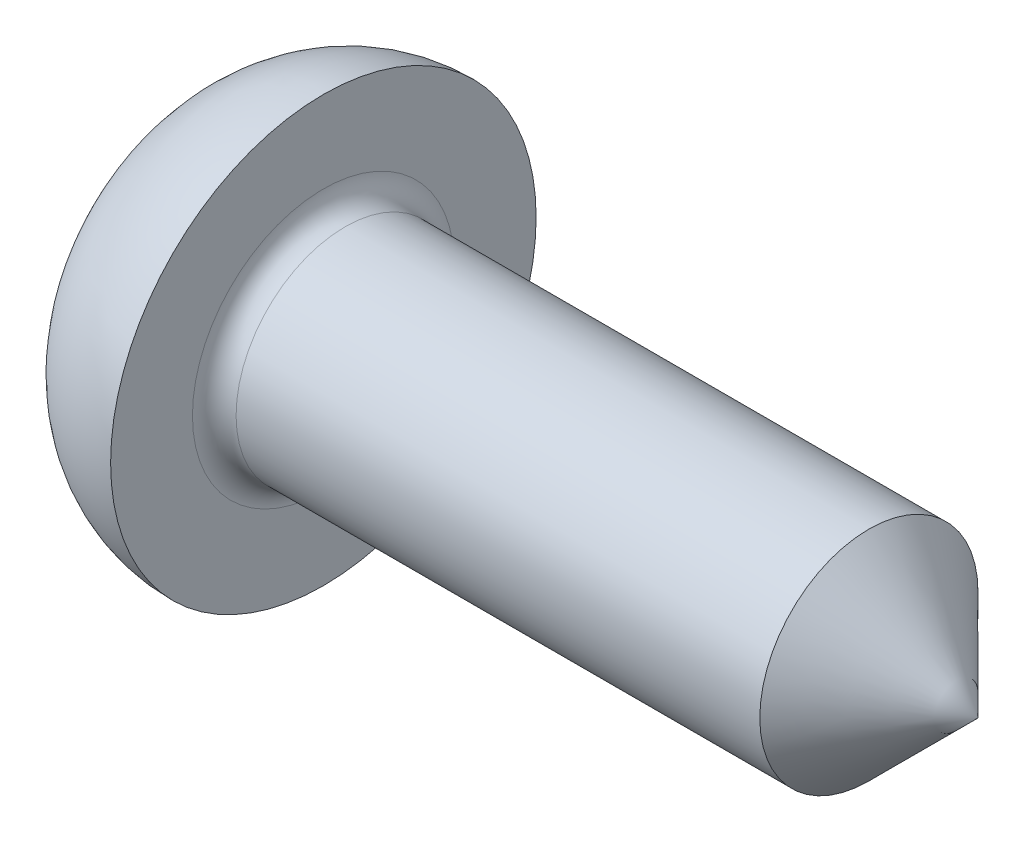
from build123d import *

# Parameters (mm, degrees)
FILLET2_R = 0.2


with BuildPart() as part:
    # Sketch1 → Revolve1 (revolve)
    with BuildSketch(Plane(origin=(0, 0, 0), x_dir=(1, 0, 0), z_dir=(0, 1, 0)), mode=Mode.PRIVATE) as revolve1_sk:
        with BuildLine():
            Line((1.6, 1), (7.6, 1))
            Line((7.6, 1), (7.6, 0))
            Line((7.6, 0), (0, 0))
            ThreePointArc((0, 0), (0.12318754, 0.742622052), (0.479554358, 1.405694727))
            ThreePointArc((0.479554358, 1.405694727), (0.97590539, 1.809326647), (1.6, 1.95))
            Line((1.6, 1.95), (1.6, 1))
        make_face()
    revolve(revolve1_sk.sketch.rotate(Axis((-13.629268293, 0, 0), (1, 0, 0)), 180), axis=Axis((-13.629268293, 0, 0), (1, 0, 0)))

    # Fillet2
    fillet2_edges = [part.edges().sort_by_distance(p)[0] for p in [
        (1.6, 0, -1),
    ]]
    fillet(fillet2_edges, radius=FILLET2_R)

    # Sketch4 → Cut-Revolve1 (revolve, cut)
    with BuildSketch(Plane(origin=(0, 0, 0), x_dir=(1, 0, 0), z_dir=(0, 1, 0)), mode=Mode.PRIVATE) as cut_revolve1_sk:
        Polygon((8.333454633, 0), (8.333454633, 21), (-13.4, 21), (7.6, 0), align=None)
    revolve(cut_revolve1_sk.sketch.rotate(Axis((4.782773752, 0, 0), (1, 0, 0)), 180), axis=Axis((4.782773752, 0, 0), (1, 0, 0)), mode=Mode.SUBTRACT)

    # Sketch2 → Cut-Loft1 section 0
    with BuildSketch(Plane(origin=(0, 0, 0), x_dir=(0, 0, -1), z_dir=(1, 0, 0)), mode=Mode.PRIVATE) as cut_loft1_s0:
        with BuildLine():
            Line((-0.3125, 0.3125), (-1.25, 0.3125))
            Line((-1.25, 0.3125), (-1.25, -0.3125))
            Line((-1.25, -0.3125), (-0.3125, -0.3125))
            Line((-0.3125, -0.3125), (-0.3125, -1.25))
            Line((-0.3125, -1.25), (0.3125, -1.25))
            Line((0.3125, -1.25), (0.3125, -0.3125))
            Line((0.3125, -0.3125), (1.25, -0.3125))
            Line((1.25, -0.3125), (1.25, 0.3125))
            Line((1.25, 0.3125), (0.3125, 0.3125))
            Line((0.3125, 0.3125), (0.3125, 1.25))
            Line((0.3125, 1.25), (-0.3125, 1.25))
            Line((-0.3125, 1.25), (-0.3125, 0.3125))
        make_face()
    loft([Vertex(1.85, 0, 0), cut_loft1_s0.sketch], mode=Mode.SUBTRACT)


solid = part.part
